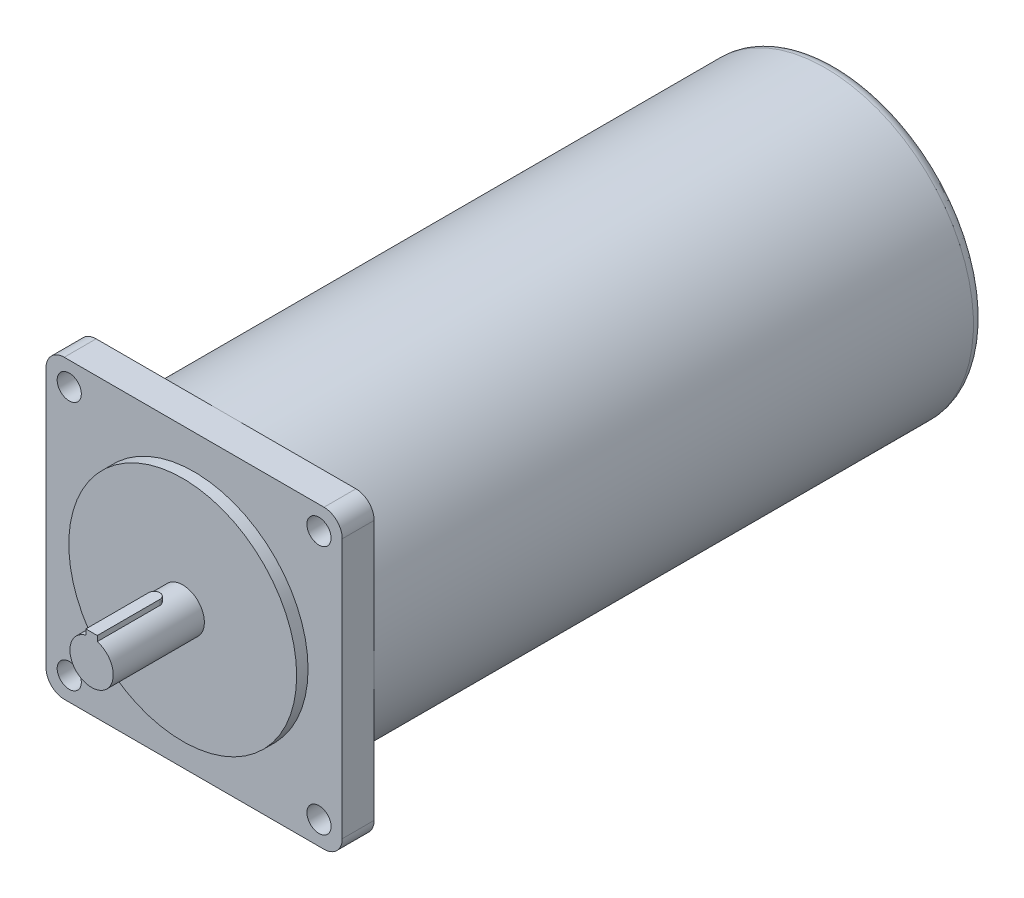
ISO-10303-21;
HEADER;
FILE_DESCRIPTION(('STEP AP214'),'2;1');
FILE_NAME('part.step','',(''),(''),'','','');
FILE_SCHEMA(('AUTOMOTIVE_DESIGN { 1 0 10303 214 1 1 1 1 }'));
ENDSEC;
DATA;
#1=APPLICATION_CONTEXT('core data for automotive mechanical design processes');
#2=APPLICATION_PROTOCOL_DEFINITION('international standard','automotive_design',2000,#1);
#3=PRODUCT_CONTEXT('',#1,'mechanical');
#4=PRODUCT('Part','Part','',(#3));
#5=PRODUCT_RELATED_PRODUCT_CATEGORY('part','',(#4));
#6=PRODUCT_DEFINITION_FORMATION('','',#4);
#7=PRODUCT_DEFINITION_CONTEXT('part definition',#1,'design');
#8=PRODUCT_DEFINITION('design','',#6,#7);
#9=PRODUCT_DEFINITION_SHAPE('','',#8);
#10=(LENGTH_UNIT() NAMED_UNIT(*) SI_UNIT(.MILLI.,.METRE.));
#11=(NAMED_UNIT(*) PLANE_ANGLE_UNIT() SI_UNIT($,.RADIAN.));
#12=(NAMED_UNIT(*) SI_UNIT($,.STERADIAN.) SOLID_ANGLE_UNIT());
#13=UNCERTAINTY_MEASURE_WITH_UNIT(LENGTH_MEASURE(1.E-05),#10,'distance_accuracy_value','');
#14=(GEOMETRIC_REPRESENTATION_CONTEXT(3) GLOBAL_UNCERTAINTY_ASSIGNED_CONTEXT((#13)) GLOBAL_UNIT_ASSIGNED_CONTEXT((#10,
#11,#12)) REPRESENTATION_CONTEXT('',''));
#15=CARTESIAN_POINT('',(0.,0.,0.));
#16=DIRECTION('',(0.,0.,1.));
#17=DIRECTION('',(1.,0.,0.));
#18=AXIS2_PLACEMENT_3D('',#15,#16,#17);
#19=CARTESIAN_POINT('',(57.,-57.,-19.));
#20=DIRECTION('',(0.,0.,1.));
#21=DIRECTION('',(1.,0.,0.));
#22=AXIS2_PLACEMENT_3D('',#19,#20,#21);
#23=PLANE('',#22);
#24=CARTESIAN_POINT('',(-54.8,54.8,-19.));
#25=DIRECTION('',(0.,0.,-1.));
#26=DIRECTION('',(-1.,0.,0.));
#27=AXIS2_PLACEMENT_3D('',#24,#25,#26);
#28=CIRCLE('',#27,5.3);
#29=CARTESIAN_POINT('',(-60.1,54.8,-19.));
#30=VERTEX_POINT('',#29);
#31=EDGE_CURVE('E182',#30,#30,#28,.T.);
#32=ORIENTED_EDGE('',*,*,#31,.F.);
#33=EDGE_LOOP('',(#32));
#34=FACE_BOUND('',#33,.T.);
#35=CARTESIAN_POINT('',(0.,0.,-19.));
#36=DIRECTION('',(0.,0.,-1.));
#37=DIRECTION('',(-1.,0.,0.));
#38=AXIS2_PLACEMENT_3D('',#35,#36,#37);
#39=CIRCLE('',#38,65.);
#40=CARTESIAN_POINT('',(-65.,0.,-19.));
#41=VERTEX_POINT('',#40);
#42=CARTESIAN_POINT('',(0.,65.,-19.));
#43=VERTEX_POINT('',#42);
#44=EDGE_CURVE('E158',#41,#43,#39,.T.);
#45=ORIENTED_EDGE('',*,*,#44,.F.);
#46=DIRECTION('',(0.,1.,0.));
#47=VECTOR('',#46,1.);
#48=CARTESIAN_POINT('',(-65.,56.9999999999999,-19.));
#49=LINE('',#48,#47);
#50=CARTESIAN_POINT('',(-65.,56.9999999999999,-19.));
#51=VERTEX_POINT('',#50);
#52=EDGE_CURVE('E147',#41,#51,#49,.T.);
#53=ORIENTED_EDGE('',*,*,#52,.T.);
#54=CARTESIAN_POINT('',(-57.,57.,-19.));
#55=DIRECTION('',(0.,0.,-1.));
#56=DIRECTION('',(1.,0.,0.));
#57=AXIS2_PLACEMENT_3D('',#54,#55,#56);
#58=CIRCLE('',#57,8.);
#59=CARTESIAN_POINT('',(-56.9999999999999,65.,-19.));
#60=VERTEX_POINT('',#59);
#61=EDGE_CURVE('E146',#51,#60,#58,.T.);
#62=ORIENTED_EDGE('',*,*,#61,.T.);
#63=DIRECTION('',(1.,0.,0.));
#64=VECTOR('',#63,1.);
#65=CARTESIAN_POINT('',(0.,65.,-19.));
#66=LINE('',#65,#64);
#67=EDGE_CURVE('E160',#60,#43,#66,.T.);
#68=ORIENTED_EDGE('',*,*,#67,.T.);
#69=EDGE_LOOP('',(#45,#53,#62,#68));
#70=FACE_BOUND('',#69,.T.);
#71=ADVANCED_FACE('F33',(#34,#70),#23,.F.);
#72=CARTESIAN_POINT('',(54.8,54.8,-19.));
#73=DIRECTION('',(0.,0.,-1.));
#74=DIRECTION('',(-1.,0.,0.));
#75=AXIS2_PLACEMENT_3D('',#72,#73,#74);
#76=CIRCLE('',#75,5.3);
#77=CARTESIAN_POINT('',(49.5,54.8,-19.));
#78=VERTEX_POINT('',#77);
#79=EDGE_CURVE('E188',#78,#78,#76,.T.);
#80=ORIENTED_EDGE('',*,*,#79,.F.);
#81=EDGE_LOOP('',(#80));
#82=FACE_BOUND('',#81,.T.);
#83=CARTESIAN_POINT('',(65.,0.,-19.));
#84=VERTEX_POINT('',#83);
#85=EDGE_CURVE('E56',#43,#84,#39,.T.);
#86=ORIENTED_EDGE('',*,*,#85,.F.);
#87=CARTESIAN_POINT('',(56.9999999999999,65.,-19.));
#88=VERTEX_POINT('',#87);
#89=EDGE_CURVE('E203',#43,#88,#66,.T.);
#90=ORIENTED_EDGE('',*,*,#89,.T.);
#91=CARTESIAN_POINT('',(57.,57.,-19.));
#92=DIRECTION('',(0.,0.,-1.));
#93=DIRECTION('',(1.,0.,0.));
#94=AXIS2_PLACEMENT_3D('',#91,#92,#93);
#95=CIRCLE('',#94,8.);
#96=CARTESIAN_POINT('',(65.,56.9999999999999,-19.));
#97=VERTEX_POINT('',#96);
#98=EDGE_CURVE('E205',#88,#97,#95,.T.);
#99=ORIENTED_EDGE('',*,*,#98,.T.);
#100=DIRECTION('',(0.,-1.,0.));
#101=VECTOR('',#100,1.);
#102=CARTESIAN_POINT('',(65.,-57.,-19.));
#103=LINE('',#102,#101);
#104=EDGE_CURVE('E208',#97,#84,#103,.T.);
#105=ORIENTED_EDGE('',*,*,#104,.T.);
#106=EDGE_LOOP('',(#86,#90,#99,#105));
#107=FACE_BOUND('',#106,.T.);
#108=ADVANCED_FACE('F309',(#82,#107),#23,.F.);
#109=CARTESIAN_POINT('',(54.8,-54.8,-19.));
#110=DIRECTION('',(0.,0.,-1.));
#111=DIRECTION('',(-1.,0.,0.));
#112=AXIS2_PLACEMENT_3D('',#109,#110,#111);
#113=CIRCLE('',#112,5.3);
#114=CARTESIAN_POINT('',(49.5,-54.8,-19.));
#115=VERTEX_POINT('',#114);
#116=EDGE_CURVE('E170',#115,#115,#113,.T.);
#117=ORIENTED_EDGE('',*,*,#116,.F.);
#118=EDGE_LOOP('',(#117));
#119=FACE_BOUND('',#118,.T.);
#120=CARTESIAN_POINT('',(0.,-65.,-19.));
#121=VERTEX_POINT('',#120);
#122=EDGE_CURVE('E48',#84,#121,#39,.T.);
#123=ORIENTED_EDGE('',*,*,#122,.F.);
#124=CARTESIAN_POINT('',(65.,-57.,-19.));
#125=VERTEX_POINT('',#124);
#126=EDGE_CURVE('E207',#84,#125,#103,.T.);
#127=ORIENTED_EDGE('',*,*,#126,.T.);
#128=CARTESIAN_POINT('',(57.,-57.,-19.));
#129=DIRECTION('',(0.,0.,-1.));
#130=DIRECTION('',(1.,0.,0.));
#131=AXIS2_PLACEMENT_3D('',#128,#129,#130);
#132=CIRCLE('',#131,8.);
#133=CARTESIAN_POINT('',(56.9999999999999,-65.,-19.));
#134=VERTEX_POINT('',#133);
#135=EDGE_CURVE('E194',#125,#134,#132,.T.);
#136=ORIENTED_EDGE('',*,*,#135,.T.);
#137=DIRECTION('',(-1.,0.,0.));
#138=VECTOR('',#137,1.);
#139=CARTESIAN_POINT('',(-57.,-65.,-19.));
#140=LINE('',#139,#138);
#141=EDGE_CURVE('E199',#134,#121,#140,.T.);
#142=ORIENTED_EDGE('',*,*,#141,.T.);
#143=EDGE_LOOP('',(#123,#127,#136,#142));
#144=FACE_BOUND('',#143,.T.);
#145=ADVANCED_FACE('F315',(#119,#144),#23,.F.);
#146=CARTESIAN_POINT('',(-54.8,-54.8,-19.));
#147=DIRECTION('',(0.,0.,-1.));
#148=DIRECTION('',(-1.,0.,0.));
#149=AXIS2_PLACEMENT_3D('',#146,#147,#148);
#150=CIRCLE('',#149,5.3);
#151=CARTESIAN_POINT('',(-60.1,-54.8,-19.));
#152=VERTEX_POINT('',#151);
#153=EDGE_CURVE('E176',#152,#152,#150,.T.);
#154=ORIENTED_EDGE('',*,*,#153,.F.);
#155=EDGE_LOOP('',(#154));
#156=FACE_BOUND('',#155,.T.);
#157=EDGE_CURVE('E139',#121,#41,#39,.T.);
#158=ORIENTED_EDGE('',*,*,#157,.F.);
#159=CARTESIAN_POINT('',(-57.,-65.,-19.));
#160=VERTEX_POINT('',#159);
#161=EDGE_CURVE('E197',#121,#160,#140,.T.);
#162=ORIENTED_EDGE('',*,*,#161,.T.);
#163=CARTESIAN_POINT('',(-57.,-57.,-19.));
#164=DIRECTION('',(0.,0.,-1.));
#165=DIRECTION('',(1.,0.,0.));
#166=AXIS2_PLACEMENT_3D('',#163,#164,#165);
#167=CIRCLE('',#166,8.);
#168=CARTESIAN_POINT('',(-65.,-56.9999999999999,-19.));
#169=VERTEX_POINT('',#168);
#170=EDGE_CURVE('E142',#160,#169,#167,.T.);
#171=ORIENTED_EDGE('',*,*,#170,.T.);
#172=EDGE_CURVE('E135',#169,#41,#49,.T.);
#173=ORIENTED_EDGE('',*,*,#172,.T.);
#174=EDGE_LOOP('',(#158,#162,#171,#173));
#175=FACE_BOUND('',#174,.T.);
#176=ADVANCED_FACE('F137',(#156,#175),#23,.F.);
#177=CARTESIAN_POINT('',(0.,0.,40.));
#178=DIRECTION('',(0.,0.,-1.));
#179=DIRECTION('',(-1.,0.,0.));
#180=AXIS2_PLACEMENT_3D('',#177,#178,#179);
#181=CYLINDRICAL_SURFACE('',#180,9.5);
#182=CARTESIAN_POINT('',(0.,0.,0.));
#183=DIRECTION('',(0.,0.,1.));
#184=DIRECTION('',(1.,0.,0.));
#185=AXIS2_PLACEMENT_3D('',#182,#183,#184);
#186=CIRCLE('',#185,9.5);
#187=CARTESIAN_POINT('',(9.5,0.,0.));
#188=VERTEX_POINT('',#187);
#189=EDGE_CURVE('E277',#188,#188,#186,.T.);
#190=ORIENTED_EDGE('',*,*,#189,.T.);
#191=EDGE_LOOP('',(#190));
#192=FACE_BOUND('',#191,.T.);
#193=DIRECTION('',(0.,0.,-1.));
#194=VECTOR('',#193,1.);
#195=CARTESIAN_POINT('',(-2.5,9.16515138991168,40.));
#196=LINE('',#195,#194);
#197=CARTESIAN_POINT('',(-2.5,9.16515138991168,12.5));
#198=VERTEX_POINT('',#197);
#199=CARTESIAN_POINT('',(-2.5,9.16515138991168,40.));
#200=VERTEX_POINT('',#199);
#201=EDGE_CURVE('E274',#198,#200,#196,.F.);
#202=ORIENTED_EDGE('',*,*,#201,.F.);
#203=CARTESIAN_POINT('',(0.,9.5,10.));
#204=CARTESIAN_POINT('',(-0.137884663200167,9.4999978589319,10.0000034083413));
#205=CARTESIAN_POINT('',(-0.275806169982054,9.49696845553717,10.0114455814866));
#206=CARTESIAN_POINT('',(-0.547680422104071,9.48517762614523,10.0568336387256));
#207=CARTESIAN_POINT('',(-0.681631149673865,9.47641333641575,10.0907907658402));
#208=CARTESIAN_POINT('',(-0.941599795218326,9.45412076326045,10.1800315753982));
#209=CARTESIAN_POINT('',(-1.06762755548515,9.44059853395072,10.2352881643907));
#210=CARTESIAN_POINT('',(-1.30862652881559,9.41022151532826,10.3654600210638));
#211=CARTESIAN_POINT('',(-1.42359708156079,9.39336652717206,10.4403764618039));
#212=CARTESIAN_POINT('',(-1.64181993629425,9.35771941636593,10.6095316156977));
#213=CARTESIAN_POINT('',(-1.74478634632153,9.33889486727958,10.7041323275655));
#214=CARTESIAN_POINT('',(-1.93359084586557,9.30164002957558,10.9091965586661));
#215=CARTESIAN_POINT('',(-2.01942679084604,9.28320979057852,11.0196620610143));
#216=CARTESIAN_POINT('',(-2.17291708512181,9.24849966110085,11.2555887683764));
#217=CARTESIAN_POINT('',(-2.24024449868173,9.23226073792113,11.3812692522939));
#218=CARTESIAN_POINT('',(-2.35270147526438,9.20424780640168,11.6426621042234));
#219=CARTESIAN_POINT('',(-2.39783501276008,9.19247299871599,11.7783726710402));
#220=CARTESIAN_POINT('',(-2.46363395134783,9.17505594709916,12.0528119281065));
#221=CARTESIAN_POINT('',(-2.48481677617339,9.16928424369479,12.1914081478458));
#222=CARTESIAN_POINT('',(-2.50372582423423,9.16413995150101,12.470298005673));
#223=CARTESIAN_POINT('',(-2.50145630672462,9.16476620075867,12.6105913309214));
#224=CARTESIAN_POINT('',(-2.47393631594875,9.1722310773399,12.8848702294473));
#225=CARTESIAN_POINT('',(-2.44930986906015,9.1789010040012,13.0189237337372));
#226=CARTESIAN_POINT('',(-2.37877367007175,9.19743185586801,13.2809260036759));
#227=CARTESIAN_POINT('',(-2.33286225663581,9.2092931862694,13.4088742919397));
#228=CARTESIAN_POINT('',(-2.22054589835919,9.23702010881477,13.6566707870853));
#229=CARTESIAN_POINT('',(-2.1539205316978,9.25292841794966,13.7764141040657));
#230=CARTESIAN_POINT('',(-2.00222137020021,9.28693362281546,14.0032413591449));
#231=CARTESIAN_POINT('',(-1.91714402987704,9.30503093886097,14.1103228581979));
#232=CARTESIAN_POINT('',(-1.72775627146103,9.3420790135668,14.3123544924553));
#233=CARTESIAN_POINT('',(-1.62292126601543,9.36103863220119,14.4068119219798));
#234=CARTESIAN_POINT('',(-1.3986680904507,9.39715951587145,14.5769046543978));
#235=CARTESIAN_POINT('',(-1.27924937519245,9.41432071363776,14.6525392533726));
#236=CARTESIAN_POINT('',(-1.02846858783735,9.44501219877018,14.7830484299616));
#237=CARTESIAN_POINT('',(-0.897059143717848,9.45852716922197,14.8378358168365));
#238=CARTESIAN_POINT('',(-0.626458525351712,9.48029259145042,14.924400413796));
#239=CARTESIAN_POINT('',(-0.487269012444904,9.48854416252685,14.9561825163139));
#240=CARTESIAN_POINT('',(-0.209265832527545,9.49868456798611,14.9950653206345));
#241=CARTESIAN_POINT('',(-0.070552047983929,9.50074610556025,15.0028361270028));
#242=CARTESIAN_POINT('',(0.206196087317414,9.49876969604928,14.9953236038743));
#243=CARTESIAN_POINT('',(0.344230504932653,9.49473236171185,14.9800425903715));
#244=CARTESIAN_POINT('',(0.613323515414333,9.48112321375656,14.9274104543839));
#245=CARTESIAN_POINT('',(0.744460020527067,9.47164474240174,14.8904313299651));
#246=CARTESIAN_POINT('',(0.998656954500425,9.44822690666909,14.7958831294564));
#247=CARTESIAN_POINT('',(1.12171651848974,9.43428706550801,14.7383118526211));
#248=CARTESIAN_POINT('',(1.35888360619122,9.40308612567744,14.6029586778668));
#249=CARTESIAN_POINT('',(1.47277384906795,9.38576639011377,14.5248099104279));
#250=CARTESIAN_POINT('',(1.68605972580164,9.34980860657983,14.3509829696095));
#251=CARTESIAN_POINT('',(1.78545256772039,9.33117030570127,14.2553014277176));
#252=CARTESIAN_POINT('',(1.96973268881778,9.29404354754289,14.0460009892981));
#253=CARTESIAN_POINT('',(2.05414772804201,9.27557319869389,13.9319623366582));
#254=CARTESIAN_POINT('',(2.20265077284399,9.24143699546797,13.690949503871));
#255=CARTESIAN_POINT('',(2.26673964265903,9.22577102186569,13.5639758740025));
#256=CARTESIAN_POINT('',(2.37228864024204,9.1991961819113,13.3013437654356));
#257=CARTESIAN_POINT('',(2.41388084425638,9.18825962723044,13.165741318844));
#258=CARTESIAN_POINT('',(2.47357685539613,9.17237100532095,12.8891317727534));
#259=CARTESIAN_POINT('',(2.49168647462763,9.16741745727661,12.7481260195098));
#260=CARTESIAN_POINT('',(2.5035754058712,9.16417710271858,12.4695408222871));
#261=CARTESIAN_POINT('',(2.49811278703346,9.16568256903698,12.3319956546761));
#262=CARTESIAN_POINT('',(2.46476570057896,9.17470557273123,12.0598619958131));
#263=CARTESIAN_POINT('',(2.43688178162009,9.18222296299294,11.9252734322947));
#264=CARTESIAN_POINT('',(2.35991776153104,9.20230081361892,11.6637995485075));
#265=CARTESIAN_POINT('',(2.31099432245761,9.21482395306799,11.5368650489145));
#266=CARTESIAN_POINT('',(2.19346205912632,9.2435040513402,11.2929108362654));
#267=CARTESIAN_POINT('',(2.12485022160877,9.25966156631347,11.1758926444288));
#268=CARTESIAN_POINT('',(1.96757430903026,9.29436941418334,10.9514645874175));
#269=CARTESIAN_POINT('',(1.87839103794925,9.31297513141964,10.8444270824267));
#270=CARTESIAN_POINT('',(1.68349652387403,9.35016921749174,10.6465905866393));
#271=CARTESIAN_POINT('',(1.57778128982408,9.36875758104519,10.5557955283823));
#272=CARTESIAN_POINT('',(1.35018708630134,9.40428175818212,10.3911797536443));
#273=CARTESIAN_POINT('',(1.22801920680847,9.42117547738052,10.3177486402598));
#274=CARTESIAN_POINT('',(0.972633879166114,9.45095016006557,10.1925825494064));
#275=CARTESIAN_POINT('',(0.839423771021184,9.46383376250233,10.1408332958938));
#276=CARTESIAN_POINT('',(0.588875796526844,9.48241870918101,10.0674519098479));
#277=CARTESIAN_POINT('',(0.472643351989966,9.4889642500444,10.0422152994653));
#278=CARTESIAN_POINT('',(0.237616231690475,9.49775561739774,10.0084886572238));
#279=CARTESIAN_POINT('',(0.118821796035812,9.50000184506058,9.99999706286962));
#280=CARTESIAN_POINT('',(0.,9.5,10.));
#281=B_SPLINE_CURVE_WITH_KNOTS('',3,(#203,#204,#205,#206,#207,#208,#209,#210,#211,#212,#213,
#214,#215,#216,#217,#218,#219,#220,#221,#222,#223,#224,#225,#226,#227,#228,#229,#230,#231,#232,
#233,#234,#235,#236,#237,#238,#239,#240,#241,#242,#243,#244,#245,#246,#247,#248,#249,#250,#251,
#252,#253,#254,#255,#256,#257,#258,#259,#260,#261,#262,#263,#264,#265,#266,#267,#268,#269,#270,
#271,#272,#273,#274,#275,#276,#277,#278,#279,#280),.UNSPECIFIED.,.T.,.F.,(4,2,2,2,2,2,2,2,2,2,2,
2,2,2,2,2,2,2,2,2,2,2,2,2,2,2,2,2,2,2,2,2,2,2,2,2,2,2,4),(0.,0.41321830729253,0.826643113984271,
1.23954376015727,1.65246904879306,2.07379267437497,2.49516901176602,2.92356960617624,
3.35189345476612,3.77077570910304,4.18958189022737,4.59704611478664,5.00454214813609,
5.41653210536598,5.82860129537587,6.25374475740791,6.67890411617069,7.10582259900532,
7.53265026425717,7.9474532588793,8.36221458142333,8.77006471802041,9.17795845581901,
9.59368485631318,10.0094912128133,10.4366941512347,10.8638789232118,11.2885277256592,
11.7130714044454,12.1240655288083,12.5350495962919,12.9430250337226,13.3510629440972,
13.7708169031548,14.1906723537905,14.6192052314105,15.0474555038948,15.4035786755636,
15.7596686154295),.UNSPECIFIED.);
#282=CARTESIAN_POINT('',(2.5,9.16515138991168,12.5));
#283=VERTEX_POINT('',#282);
#284=EDGE_CURVE('E165',#283,#198,#281,.T.);
#285=ORIENTED_EDGE('',*,*,#284,.F.);
#286=DIRECTION('',(0.,0.,-1.));
#287=VECTOR('',#286,1.);
#288=CARTESIAN_POINT('',(2.5,9.16515138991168,40.));
#289=LINE('',#288,#287);
#290=CARTESIAN_POINT('',(2.5,9.16515138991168,40.));
#291=VERTEX_POINT('',#290);
#292=EDGE_CURVE('E271',#291,#283,#289,.T.);
#293=ORIENTED_EDGE('',*,*,#292,.F.);
#294=CARTESIAN_POINT('',(0.,0.,40.));
#295=DIRECTION('',(0.,0.,1.));
#296=DIRECTION('',(1.,0.,0.));
#297=AXIS2_PLACEMENT_3D('',#294,#295,#296);
#298=CIRCLE('',#297,9.5);
#299=EDGE_CURVE('E278',#200,#291,#298,.T.);
#300=ORIENTED_EDGE('',*,*,#299,.F.);
#301=EDGE_LOOP('',(#202,#285,#293,#300));
#302=FACE_BOUND('',#301,.T.);
#303=ADVANCED_FACE('F288',(#192,#302),#181,.T.);
#304=CARTESIAN_POINT('',(0.,0.,0.));
#305=DIRECTION('',(0.,0.,1.));
#306=DIRECTION('',(1.,0.,0.));
#307=AXIS2_PLACEMENT_3D('',#304,#305,#306);
#308=PLANE('',#307);
#309=CARTESIAN_POINT('',(0.,0.,0.));
#310=DIRECTION('',(0.,0.,1.));
#311=DIRECTION('',(1.,0.,0.));
#312=AXIS2_PLACEMENT_3D('',#309,#310,#311);
#313=CIRCLE('',#312,50.);
#314=CARTESIAN_POINT('',(50.,0.,0.));
#315=VERTEX_POINT('',#314);
#316=EDGE_CURVE('E167',#315,#315,#313,.T.);
#317=ORIENTED_EDGE('',*,*,#316,.T.);
#318=EDGE_LOOP('',(#317));
#319=FACE_BOUND('',#318,.T.);
#320=ORIENTED_EDGE('',*,*,#189,.F.);
#321=EDGE_LOOP('',(#320));
#322=FACE_BOUND('',#321,.T.);
#323=ADVANCED_FACE('F306',(#319,#322),#308,.T.);
#324=CARTESIAN_POINT('',(0.,0.,-5.));
#325=DIRECTION('',(0.,0.,1.));
#326=DIRECTION('',(1.,0.,0.));
#327=AXIS2_PLACEMENT_3D('',#324,#325,#326);
#328=CYLINDRICAL_SURFACE('',#327,50.);
#329=CARTESIAN_POINT('',(0.,0.,-5.));
#330=DIRECTION('',(0.,0.,1.));
#331=DIRECTION('',(1.,0.,0.));
#332=AXIS2_PLACEMENT_3D('',#329,#330,#331);
#333=CIRCLE('',#332,50.);
#334=CARTESIAN_POINT('',(50.,0.,-5.));
#335=VERTEX_POINT('',#334);
#336=EDGE_CURVE('E247',#335,#335,#333,.F.);
#337=ORIENTED_EDGE('',*,*,#336,.F.);
#338=EDGE_LOOP('',(#337));
#339=FACE_BOUND('',#338,.T.);
#340=ORIENTED_EDGE('',*,*,#316,.F.);
#341=EDGE_LOOP('',(#340));
#342=FACE_BOUND('',#341,.T.);
#343=ADVANCED_FACE('F301',(#339,#342),#328,.T.);
#344=CARTESIAN_POINT('',(0.,0.,40.));
#345=DIRECTION('',(0.,0.,1.));
#346=DIRECTION('',(1.,0.,0.));
#347=AXIS2_PLACEMENT_3D('',#344,#345,#346);
#348=PLANE('',#347);
#349=ORIENTED_EDGE('',*,*,#299,.T.);
#350=DIRECTION('',(0.,-1.,0.));
#351=VECTOR('',#350,1.);
#352=CARTESIAN_POINT('',(2.5,11.5,40.));
#353=LINE('',#352,#351);
#354=CARTESIAN_POINT('',(2.5,11.5,40.));
#355=VERTEX_POINT('',#354);
#356=EDGE_CURVE('E262',#355,#291,#353,.T.);
#357=ORIENTED_EDGE('',*,*,#356,.F.);
#358=DIRECTION('',(1.,0.,0.));
#359=VECTOR('',#358,1.);
#360=CARTESIAN_POINT('',(-2.5,11.5,40.));
#361=LINE('',#360,#359);
#362=CARTESIAN_POINT('',(-2.5,11.5,40.));
#363=VERTEX_POINT('',#362);
#364=EDGE_CURVE('E255',#363,#355,#361,.T.);
#365=ORIENTED_EDGE('',*,*,#364,.F.);
#366=DIRECTION('',(0.,-1.,0.));
#367=VECTOR('',#366,1.);
#368=CARTESIAN_POINT('',(-2.5,11.5,40.));
#369=LINE('',#368,#367);
#370=EDGE_CURVE('E265',#363,#200,#369,.T.);
#371=ORIENTED_EDGE('',*,*,#370,.T.);
#372=EDGE_LOOP('',(#349,#357,#365,#371));
#373=FACE_BOUND('',#372,.T.);
#374=ADVANCED_FACE('F297',(#373),#348,.T.);
#375=CARTESIAN_POINT('',(0.,11.5,12.5));
#376=DIRECTION('',(0.,-1.,0.));
#377=DIRECTION('',(0.,0.,-1.));
#378=AXIS2_PLACEMENT_3D('',#375,#376,#377);
#379=CYLINDRICAL_SURFACE('',#378,2.5);
#380=DIRECTION('',(0.,-1.,0.));
#381=VECTOR('',#380,1.);
#382=CARTESIAN_POINT('',(2.5,11.5,12.5));
#383=LINE('',#382,#381);
#384=CARTESIAN_POINT('',(2.5,11.5,12.5));
#385=VERTEX_POINT('',#384);
#386=EDGE_CURVE('E259',#385,#283,#383,.T.);
#387=ORIENTED_EDGE('',*,*,#386,.T.);
#388=ORIENTED_EDGE('',*,*,#284,.T.);
#389=DIRECTION('',(0.,-1.,0.));
#390=VECTOR('',#389,1.);
#391=CARTESIAN_POINT('',(-2.5,11.5,12.5));
#392=LINE('',#391,#390);
#393=CARTESIAN_POINT('',(-2.5,11.5,12.5));
#394=VERTEX_POINT('',#393);
#395=EDGE_CURVE('E268',#394,#198,#392,.T.);
#396=ORIENTED_EDGE('',*,*,#395,.F.);
#397=CARTESIAN_POINT('',(0.,11.5,12.5));
#398=DIRECTION('',(0.,1.,0.));
#399=DIRECTION('',(0.,0.,1.));
#400=AXIS2_PLACEMENT_3D('',#397,#398,#399);
#401=CIRCLE('',#400,2.5);
#402=EDGE_CURVE('E250',#385,#394,#401,.T.);
#403=ORIENTED_EDGE('',*,*,#402,.F.);
#404=EDGE_LOOP('',(#387,#388,#396,#403));
#405=FACE_BOUND('',#404,.T.);
#406=ADVANCED_FACE('F292',(#405),#379,.T.);
#407=CARTESIAN_POINT('',(-2.5,11.5,12.5));
#408=DIRECTION('',(1.,0.,0.));
#409=DIRECTION('',(0.,0.,-1.));
#410=AXIS2_PLACEMENT_3D('',#407,#408,#409);
#411=PLANE('',#410);
#412=ORIENTED_EDGE('',*,*,#395,.T.);
#413=ORIENTED_EDGE('',*,*,#201,.T.);
#414=ORIENTED_EDGE('',*,*,#370,.F.);
#415=DIRECTION('',(0.,0.,1.));
#416=VECTOR('',#415,1.);
#417=CARTESIAN_POINT('',(-2.5,11.5,12.5));
#418=LINE('',#417,#416);
#419=EDGE_CURVE('E253',#394,#363,#418,.T.);
#420=ORIENTED_EDGE('',*,*,#419,.F.);
#421=EDGE_LOOP('',(#412,#413,#414,#420));
#422=FACE_BOUND('',#421,.T.);
#423=ADVANCED_FACE('F296',(#422),#411,.F.);
#424=CARTESIAN_POINT('',(2.5,11.5,40.));
#425=DIRECTION('',(-1.,0.,0.));
#426=DIRECTION('',(0.,0.,1.));
#427=AXIS2_PLACEMENT_3D('',#424,#425,#426);
#428=PLANE('',#427);
#429=ORIENTED_EDGE('',*,*,#356,.T.);
#430=ORIENTED_EDGE('',*,*,#292,.T.);
#431=ORIENTED_EDGE('',*,*,#386,.F.);
#432=DIRECTION('',(0.,0.,-1.));
#433=VECTOR('',#432,1.);
#434=CARTESIAN_POINT('',(2.5,11.5,40.));
#435=LINE('',#434,#433);
#436=EDGE_CURVE('E257',#355,#385,#435,.T.);
#437=ORIENTED_EDGE('',*,*,#436,.F.);
#438=EDGE_LOOP('',(#429,#430,#431,#437));
#439=FACE_BOUND('',#438,.T.);
#440=ADVANCED_FACE('F406',(#439),#428,.F.);
#441=CARTESIAN_POINT('',(0.,11.5,12.5));
#442=DIRECTION('',(0.,1.,0.));
#443=DIRECTION('',(0.,0.,1.));
#444=AXIS2_PLACEMENT_3D('',#441,#442,#443);
#445=PLANE('',#444);
#446=ORIENTED_EDGE('',*,*,#402,.T.);
#447=ORIENTED_EDGE('',*,*,#419,.T.);
#448=ORIENTED_EDGE('',*,*,#364,.T.);
#449=ORIENTED_EDGE('',*,*,#436,.T.);
#450=EDGE_LOOP('',(#446,#447,#448,#449));
#451=FACE_BOUND('',#450,.T.);
#452=ADVANCED_FACE('F342',(#451),#445,.T.);
#453=CARTESIAN_POINT('',(57.,-57.,-5.));
#454=DIRECTION('',(0.,0.,1.));
#455=DIRECTION('',(1.,0.,0.));
#456=AXIS2_PLACEMENT_3D('',#453,#454,#455);
#457=PLANE('',#456);
#458=ORIENTED_EDGE('',*,*,#336,.T.);
#459=EDGE_LOOP('',(#458));
#460=FACE_BOUND('',#459,.T.);
#461=CARTESIAN_POINT('',(-54.8,-54.8,-5.));
#462=DIRECTION('',(0.,0.,-1.));
#463=DIRECTION('',(-1.,0.,0.));
#464=AXIS2_PLACEMENT_3D('',#461,#462,#463);
#465=CIRCLE('',#464,5.3);
#466=CARTESIAN_POINT('',(-60.1,-54.8,-5.));
#467=VERTEX_POINT('',#466);
#468=EDGE_CURVE('E173',#467,#467,#465,.T.);
#469=ORIENTED_EDGE('',*,*,#468,.T.);
#470=EDGE_LOOP('',(#469));
#471=FACE_BOUND('',#470,.T.);
#472=CARTESIAN_POINT('',(54.8,54.8,-5.));
#473=DIRECTION('',(0.,0.,-1.));
#474=DIRECTION('',(-1.,0.,0.));
#475=AXIS2_PLACEMENT_3D('',#472,#473,#474);
#476=CIRCLE('',#475,5.3);
#477=CARTESIAN_POINT('',(49.5,54.8,-5.));
#478=VERTEX_POINT('',#477);
#479=EDGE_CURVE('E185',#478,#478,#476,.T.);
#480=ORIENTED_EDGE('',*,*,#479,.T.);
#481=EDGE_LOOP('',(#480));
#482=FACE_BOUND('',#481,.T.);
#483=CARTESIAN_POINT('',(57.,-57.,-5.));
#484=DIRECTION('',(0.,0.,-1.));
#485=DIRECTION('',(1.,0.,0.));
#486=AXIS2_PLACEMENT_3D('',#483,#484,#485);
#487=CIRCLE('',#486,8.);
#488=CARTESIAN_POINT('',(65.,-57.,-5.));
#489=VERTEX_POINT('',#488);
#490=CARTESIAN_POINT('',(56.9999999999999,-65.,-5.));
#491=VERTEX_POINT('',#490);
#492=EDGE_CURVE('E191',#489,#491,#487,.T.);
#493=ORIENTED_EDGE('',*,*,#492,.F.);
#494=DIRECTION('',(0.,-1.,0.));
#495=VECTOR('',#494,1.);
#496=CARTESIAN_POINT('',(65.,-57.,-5.));
#497=LINE('',#496,#495);
#498=CARTESIAN_POINT('',(65.,56.9999999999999,-5.));
#499=VERTEX_POINT('',#498);
#500=EDGE_CURVE('E198',#499,#489,#497,.T.);
#501=ORIENTED_EDGE('',*,*,#500,.F.);
#502=CARTESIAN_POINT('',(57.,57.,-5.));
#503=DIRECTION('',(0.,0.,-1.));
#504=DIRECTION('',(1.,0.,0.));
#505=AXIS2_PLACEMENT_3D('',#502,#503,#504);
#506=CIRCLE('',#505,8.);
#507=CARTESIAN_POINT('',(56.9999999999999,65.,-5.));
#508=VERTEX_POINT('',#507);
#509=EDGE_CURVE('E224',#508,#499,#506,.T.);
#510=ORIENTED_EDGE('',*,*,#509,.F.);
#511=DIRECTION('',(1.,0.,0.));
#512=VECTOR('',#511,1.);
#513=CARTESIAN_POINT('',(56.9999999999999,65.,-5.));
#514=LINE('',#513,#512);
#515=CARTESIAN_POINT('',(-56.9999999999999,65.,-5.));
#516=VERTEX_POINT('',#515);
#517=EDGE_CURVE('E222',#516,#508,#514,.T.);
#518=ORIENTED_EDGE('',*,*,#517,.F.);
#519=CARTESIAN_POINT('',(-57.,57.,-5.));
#520=DIRECTION('',(0.,0.,-1.));
#521=DIRECTION('',(1.,0.,0.));
#522=AXIS2_PLACEMENT_3D('',#519,#520,#521);
#523=CIRCLE('',#522,8.);
#524=CARTESIAN_POINT('',(-65.,56.9999999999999,-5.));
#525=VERTEX_POINT('',#524);
#526=EDGE_CURVE('E219',#525,#516,#523,.T.);
#527=ORIENTED_EDGE('',*,*,#526,.F.);
#528=DIRECTION('',(0.,1.,0.));
#529=VECTOR('',#528,1.);
#530=CARTESIAN_POINT('',(-65.,56.9999999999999,-5.));
#531=LINE('',#530,#529);
#532=CARTESIAN_POINT('',(-65.,-56.9999999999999,-5.));
#533=VERTEX_POINT('',#532);
#534=EDGE_CURVE('E217',#533,#525,#531,.T.);
#535=ORIENTED_EDGE('',*,*,#534,.F.);
#536=CARTESIAN_POINT('',(-57.,-57.,-5.));
#537=DIRECTION('',(0.,0.,-1.));
#538=DIRECTION('',(1.,0.,0.));
#539=AXIS2_PLACEMENT_3D('',#536,#537,#538);
#540=CIRCLE('',#539,8.);
#541=CARTESIAN_POINT('',(-57.,-65.,-5.));
#542=VERTEX_POINT('',#541);
#543=EDGE_CURVE('E215',#542,#533,#540,.T.);
#544=ORIENTED_EDGE('',*,*,#543,.F.);
#545=DIRECTION('',(-1.,0.,0.));
#546=VECTOR('',#545,1.);
#547=CARTESIAN_POINT('',(-57.,-65.,-5.));
#548=LINE('',#547,#546);
#549=EDGE_CURVE('E213',#491,#542,#548,.T.);
#550=ORIENTED_EDGE('',*,*,#549,.F.);
#551=EDGE_LOOP('',(#493,#501,#510,#518,#527,#535,#544,#550));
#552=FACE_BOUND('',#551,.T.);
#553=CARTESIAN_POINT('',(-54.8,54.8,-5.));
#554=DIRECTION('',(0.,0.,-1.));
#555=DIRECTION('',(-1.,0.,0.));
#556=AXIS2_PLACEMENT_3D('',#553,#554,#555);
#557=CIRCLE('',#556,5.3);
#558=CARTESIAN_POINT('',(-60.1,54.8,-5.));
#559=VERTEX_POINT('',#558);
#560=EDGE_CURVE('E179',#559,#559,#557,.T.);
#561=ORIENTED_EDGE('',*,*,#560,.T.);
#562=EDGE_LOOP('',(#561));
#563=FACE_BOUND('',#562,.T.);
#564=CARTESIAN_POINT('',(54.8,-54.8,-5.));
#565=DIRECTION('',(0.,0.,-1.));
#566=DIRECTION('',(-1.,0.,0.));
#567=AXIS2_PLACEMENT_3D('',#564,#565,#566);
#568=CIRCLE('',#567,5.3);
#569=CARTESIAN_POINT('',(49.5,-54.8,-5.));
#570=VERTEX_POINT('',#569);
#571=EDGE_CURVE('E162',#570,#570,#568,.T.);
#572=ORIENTED_EDGE('',*,*,#571,.T.);
#573=EDGE_LOOP('',(#572));
#574=FACE_BOUND('',#573,.T.);
#575=ADVANCED_FACE('F338',(#460,#471,#482,#552,#563,#574),#457,.T.);
#576=CARTESIAN_POINT('',(57.,-57.,-19.));
#577=DIRECTION('',(0.,0.,1.));
#578=DIRECTION('',(1.,0.,0.));
#579=AXIS2_PLACEMENT_3D('',#576,#577,#578);
#580=CYLINDRICAL_SURFACE('',#579,8.);
#581=ORIENTED_EDGE('',*,*,#492,.T.);
#582=DIRECTION('',(0.,0.,1.));
#583=VECTOR('',#582,1.);
#584=CARTESIAN_POINT('',(56.9999999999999,-65.,-19.));
#585=LINE('',#584,#583);
#586=EDGE_CURVE('E244',#134,#491,#585,.T.);
#587=ORIENTED_EDGE('',*,*,#586,.F.);
#588=ORIENTED_EDGE('',*,*,#135,.F.);
#589=DIRECTION('',(0.,0.,1.));
#590=VECTOR('',#589,1.);
#591=CARTESIAN_POINT('',(65.,-57.,-19.));
#592=LINE('',#591,#590);
#593=EDGE_CURVE('E210',#125,#489,#592,.T.);
#594=ORIENTED_EDGE('',*,*,#593,.T.);
#595=EDGE_LOOP('',(#581,#587,#588,#594));
#596=FACE_BOUND('',#595,.T.);
#597=ADVANCED_FACE('F341',(#596),#580,.T.);
#598=CARTESIAN_POINT('',(-57.,-65.,-19.));
#599=DIRECTION('',(0.,1.,0.));
#600=DIRECTION('',(-1.,0.,0.));
#601=AXIS2_PLACEMENT_3D('',#598,#599,#600);
#602=PLANE('',#601);
#603=ORIENTED_EDGE('',*,*,#549,.T.);
#604=DIRECTION('',(0.,0.,1.));
#605=VECTOR('',#604,1.);
#606=CARTESIAN_POINT('',(-57.,-65.,-19.));
#607=LINE('',#606,#605);
#608=EDGE_CURVE('E241',#160,#542,#607,.T.);
#609=ORIENTED_EDGE('',*,*,#608,.F.);
#610=ORIENTED_EDGE('',*,*,#161,.F.);
#611=ORIENTED_EDGE('',*,*,#141,.F.);
#612=ORIENTED_EDGE('',*,*,#586,.T.);
#613=EDGE_LOOP('',(#603,#609,#610,#611,#612));
#614=FACE_BOUND('',#613,.T.);
#615=ADVANCED_FACE('F397',(#614),#602,.F.);
#616=CARTESIAN_POINT('',(-57.,-57.,-19.));
#617=DIRECTION('',(0.,0.,1.));
#618=DIRECTION('',(1.,0.,0.));
#619=AXIS2_PLACEMENT_3D('',#616,#617,#618);
#620=CYLINDRICAL_SURFACE('',#619,8.);
#621=ORIENTED_EDGE('',*,*,#543,.T.);
#622=DIRECTION('',(0.,0.,1.));
#623=VECTOR('',#622,1.);
#624=CARTESIAN_POINT('',(-65.,-56.9999999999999,-19.));
#625=LINE('',#624,#623);
#626=EDGE_CURVE('E239',#169,#533,#625,.T.);
#627=ORIENTED_EDGE('',*,*,#626,.F.);
#628=ORIENTED_EDGE('',*,*,#170,.F.);
#629=ORIENTED_EDGE('',*,*,#608,.T.);
#630=EDGE_LOOP('',(#621,#627,#628,#629));
#631=FACE_BOUND('',#630,.T.);
#632=ADVANCED_FACE('F394',(#631),#620,.T.);
#633=CARTESIAN_POINT('',(-65.,56.9999999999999,-19.));
#634=DIRECTION('',(1.,0.,0.));
#635=DIRECTION('',(0.,1.,0.));
#636=AXIS2_PLACEMENT_3D('',#633,#634,#635);
#637=PLANE('',#636);
#638=ORIENTED_EDGE('',*,*,#534,.T.);
#639=DIRECTION('',(0.,0.,1.));
#640=VECTOR('',#639,1.);
#641=CARTESIAN_POINT('',(-65.,56.9999999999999,-19.));
#642=LINE('',#641,#640);
#643=EDGE_CURVE('E153',#51,#525,#642,.T.);
#644=ORIENTED_EDGE('',*,*,#643,.F.);
#645=ORIENTED_EDGE('',*,*,#52,.F.);
#646=ORIENTED_EDGE('',*,*,#172,.F.);
#647=ORIENTED_EDGE('',*,*,#626,.T.);
#648=EDGE_LOOP('',(#638,#644,#645,#646,#647));
#649=FACE_BOUND('',#648,.T.);
#650=ADVANCED_FACE('F151',(#649),#637,.F.);
#651=CARTESIAN_POINT('',(-57.,57.,-19.));
#652=DIRECTION('',(0.,0.,1.));
#653=DIRECTION('',(1.,0.,0.));
#654=AXIS2_PLACEMENT_3D('',#651,#652,#653);
#655=CYLINDRICAL_SURFACE('',#654,8.);
#656=ORIENTED_EDGE('',*,*,#526,.T.);
#657=DIRECTION('',(0.,0.,1.));
#658=VECTOR('',#657,1.);
#659=CARTESIAN_POINT('',(-56.9999999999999,65.,-19.));
#660=LINE('',#659,#658);
#661=EDGE_CURVE('E235',#60,#516,#660,.T.);
#662=ORIENTED_EDGE('',*,*,#661,.F.);
#663=ORIENTED_EDGE('',*,*,#61,.F.);
#664=ORIENTED_EDGE('',*,*,#643,.T.);
#665=EDGE_LOOP('',(#656,#662,#663,#664));
#666=FACE_BOUND('',#665,.T.);
#667=ADVANCED_FACE('F387',(#666),#655,.T.);
#668=CARTESIAN_POINT('',(56.9999999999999,65.,-19.));
#669=DIRECTION('',(0.,-1.,0.));
#670=DIRECTION('',(1.,0.,0.));
#671=AXIS2_PLACEMENT_3D('',#668,#669,#670);
#672=PLANE('',#671);
#673=ORIENTED_EDGE('',*,*,#517,.T.);
#674=DIRECTION('',(0.,0.,1.));
#675=VECTOR('',#674,1.);
#676=CARTESIAN_POINT('',(56.9999999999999,65.,-19.));
#677=LINE('',#676,#675);
#678=EDGE_CURVE('E232',#88,#508,#677,.T.);
#679=ORIENTED_EDGE('',*,*,#678,.F.);
#680=ORIENTED_EDGE('',*,*,#89,.F.);
#681=ORIENTED_EDGE('',*,*,#67,.F.);
#682=ORIENTED_EDGE('',*,*,#661,.T.);
#683=EDGE_LOOP('',(#673,#679,#680,#681,#682));
#684=FACE_BOUND('',#683,.T.);
#685=ADVANCED_FACE('F381',(#684),#672,.F.);
#686=CARTESIAN_POINT('',(57.,57.,-19.));
#687=DIRECTION('',(0.,0.,1.));
#688=DIRECTION('',(1.,0.,0.));
#689=AXIS2_PLACEMENT_3D('',#686,#687,#688);
#690=CYLINDRICAL_SURFACE('',#689,8.);
#691=ORIENTED_EDGE('',*,*,#509,.T.);
#692=DIRECTION('',(0.,0.,1.));
#693=VECTOR('',#692,1.);
#694=CARTESIAN_POINT('',(65.,56.9999999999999,-19.));
#695=LINE('',#694,#693);
#696=EDGE_CURVE('E229',#97,#499,#695,.T.);
#697=ORIENTED_EDGE('',*,*,#696,.F.);
#698=ORIENTED_EDGE('',*,*,#98,.F.);
#699=ORIENTED_EDGE('',*,*,#678,.T.);
#700=EDGE_LOOP('',(#691,#697,#698,#699));
#701=FACE_BOUND('',#700,.T.);
#702=ADVANCED_FACE('F373',(#701),#690,.T.);
#703=CARTESIAN_POINT('',(65.,-57.,-19.));
#704=DIRECTION('',(-1.,0.,0.));
#705=DIRECTION('',(0.,0.,1.));
#706=AXIS2_PLACEMENT_3D('',#703,#704,#705);
#707=PLANE('',#706);
#708=ORIENTED_EDGE('',*,*,#500,.T.);
#709=ORIENTED_EDGE('',*,*,#593,.F.);
#710=ORIENTED_EDGE('',*,*,#126,.F.);
#711=ORIENTED_EDGE('',*,*,#104,.F.);
#712=ORIENTED_EDGE('',*,*,#696,.T.);
#713=EDGE_LOOP('',(#708,#709,#710,#711,#712));
#714=FACE_BOUND('',#713,.T.);
#715=ADVANCED_FACE('F368',(#714),#707,.F.);
#716=CARTESIAN_POINT('',(54.8,54.8,-19.));
#717=DIRECTION('',(0.,0.,1.));
#718=DIRECTION('',(1.,0.,0.));
#719=AXIS2_PLACEMENT_3D('',#716,#717,#718);
#720=CYLINDRICAL_SURFACE('',#719,5.3);
#721=ORIENTED_EDGE('',*,*,#79,.T.);
#722=EDGE_LOOP('',(#721));
#723=FACE_BOUND('',#722,.T.);
#724=ORIENTED_EDGE('',*,*,#479,.F.);
#725=EDGE_LOOP('',(#724));
#726=FACE_BOUND('',#725,.T.);
#727=ADVANCED_FACE('F365',(#723,#726),#720,.F.);
#728=CARTESIAN_POINT('',(-54.8,54.8,-19.));
#729=DIRECTION('',(0.,0.,1.));
#730=DIRECTION('',(1.,0.,0.));
#731=AXIS2_PLACEMENT_3D('',#728,#729,#730);
#732=CYLINDRICAL_SURFACE('',#731,5.3);
#733=ORIENTED_EDGE('',*,*,#31,.T.);
#734=EDGE_LOOP('',(#733));
#735=FACE_BOUND('',#734,.T.);
#736=ORIENTED_EDGE('',*,*,#560,.F.);
#737=EDGE_LOOP('',(#736));
#738=FACE_BOUND('',#737,.T.);
#739=ADVANCED_FACE('F334',(#735,#738),#732,.F.);
#740=CARTESIAN_POINT('',(-54.8,-54.8,-19.));
#741=DIRECTION('',(0.,0.,1.));
#742=DIRECTION('',(1.,0.,0.));
#743=AXIS2_PLACEMENT_3D('',#740,#741,#742);
#744=CYLINDRICAL_SURFACE('',#743,5.3);
#745=ORIENTED_EDGE('',*,*,#153,.T.);
#746=EDGE_LOOP('',(#745));
#747=FACE_BOUND('',#746,.T.);
#748=ORIENTED_EDGE('',*,*,#468,.F.);
#749=EDGE_LOOP('',(#748));
#750=FACE_BOUND('',#749,.T.);
#751=ADVANCED_FACE('F330',(#747,#750),#744,.F.);
#752=CARTESIAN_POINT('',(54.8,-54.8,-19.));
#753=DIRECTION('',(0.,0.,1.));
#754=DIRECTION('',(1.,0.,0.));
#755=AXIS2_PLACEMENT_3D('',#752,#753,#754);
#756=CYLINDRICAL_SURFACE('',#755,5.3);
#757=ORIENTED_EDGE('',*,*,#116,.T.);
#758=EDGE_LOOP('',(#757));
#759=FACE_BOUND('',#758,.T.);
#760=ORIENTED_EDGE('',*,*,#571,.F.);
#761=EDGE_LOOP('',(#760));
#762=FACE_BOUND('',#761,.T.);
#763=ADVANCED_FACE('F333',(#759,#762),#756,.F.);
#764=CARTESIAN_POINT('',(0.,0.,-287.));
#765=DIRECTION('',(0.,0.,1.));
#766=DIRECTION('',(1.,0.,0.));
#767=AXIS2_PLACEMENT_3D('',#764,#765,#766);
#768=CYLINDRICAL_SURFACE('',#767,65.);
#769=CARTESIAN_POINT('',(0.,0.,-282.));
#770=DIRECTION('',(0.,0.,-1.));
#771=DIRECTION('',(-1.,0.,0.));
#772=AXIS2_PLACEMENT_3D('',#769,#770,#771);
#773=CIRCLE('',#772,65.);
#774=CARTESIAN_POINT('',(-65.,0.,-282.));
#775=VERTEX_POINT('',#774);
#776=EDGE_CURVE('E11',#775,#775,#773,.F.);
#777=ORIENTED_EDGE('',*,*,#776,.T.);
#778=EDGE_LOOP('',(#777));
#779=FACE_BOUND('',#778,.T.);
#780=ORIENTED_EDGE('',*,*,#44,.T.);
#781=ORIENTED_EDGE('',*,*,#85,.T.);
#782=ORIENTED_EDGE('',*,*,#122,.T.);
#783=ORIENTED_EDGE('',*,*,#157,.T.);
#784=EDGE_LOOP('',(#780,#781,#782,#783));
#785=FACE_BOUND('',#784,.T.);
#786=ADVANCED_FACE('F164',(#779,#785),#768,.T.);
#787=CARTESIAN_POINT('',(0.,0.,-287.));
#788=DIRECTION('',(0.,0.,-1.));
#789=DIRECTION('',(-1.,0.,0.));
#790=AXIS2_PLACEMENT_3D('',#787,#788,#789);
#791=PLANE('',#790);
#792=CARTESIAN_POINT('',(0.,0.,-287.));
#793=DIRECTION('',(0.,0.,-1.));
#794=DIRECTION('',(-1.,0.,0.));
#795=AXIS2_PLACEMENT_3D('',#792,#793,#794);
#796=CIRCLE('',#795,60.);
#797=CARTESIAN_POINT('',(-60.,0.,-287.));
#798=VERTEX_POINT('',#797);
#799=EDGE_CURVE('E41',#798,#798,#796,.T.);
#800=ORIENTED_EDGE('',*,*,#799,.T.);
#801=EDGE_LOOP('',(#800));
#802=FACE_BOUND('',#801,.T.);
#803=ADVANCED_FACE('F359',(#802),#791,.T.);
#804=CARTESIAN_POINT('',(0.,0.,-282.));
#805=DIRECTION('',(0.,0.,-1.));
#806=DIRECTION('',(-1.,0.,0.));
#807=AXIS2_PLACEMENT_3D('',#804,#805,#806);
#808=TOROIDAL_SURFACE('',#807,60.,5.);
#809=ORIENTED_EDGE('',*,*,#776,.F.);
#810=EDGE_LOOP('',(#809));
#811=FACE_BOUND('',#810,.T.);
#812=ORIENTED_EDGE('',*,*,#799,.F.);
#813=EDGE_LOOP('',(#812));
#814=FACE_BOUND('',#813,.T.);
#815=ADVANCED_FACE('F35',(#811,#814),#808,.T.);
#816=CLOSED_SHELL('',(#71,#108,#145,#176,#303,#323,#343,#374,#406,#423,#440,#452,#575,#597,#615,
#632,#650,#667,#685,#702,#715,#727,#739,#751,#763,#786,#803,#815));
#817=MANIFOLD_SOLID_BREP('B2',#816);
#818=ADVANCED_BREP_SHAPE_REPRESENTATION('',(#18,#817),#14);
#819=SHAPE_DEFINITION_REPRESENTATION(#9,#818);
ENDSEC;
END-ISO-10303-21;
